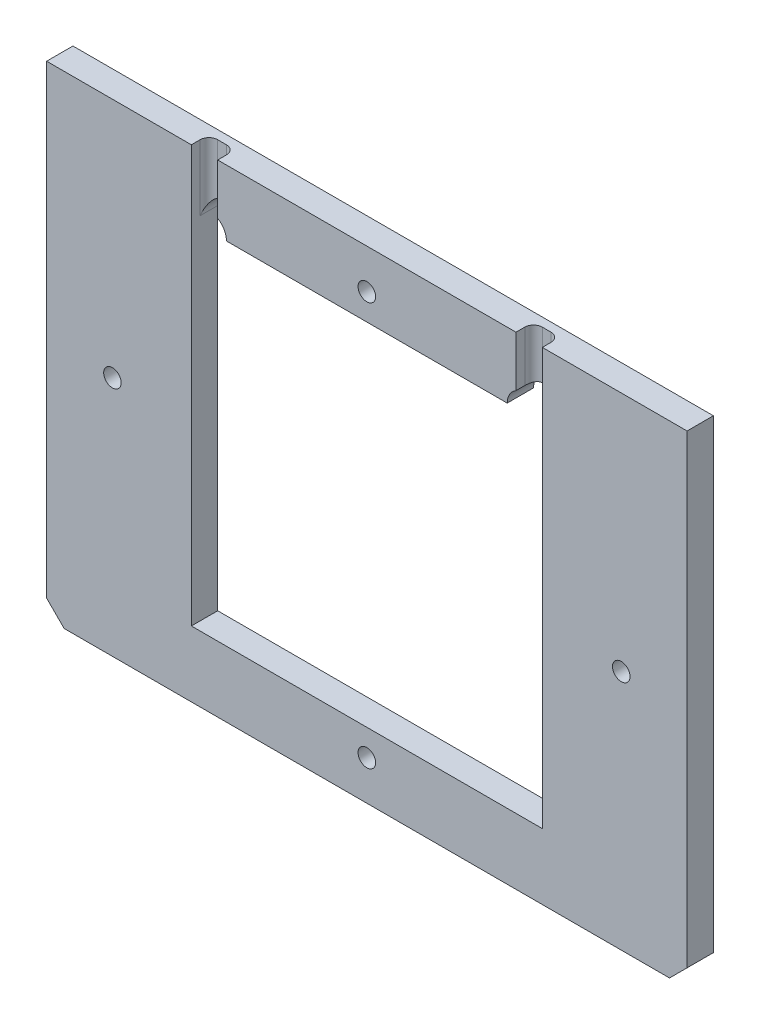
from build123d import *

# Parameters (mm, degrees)
ESQUISSE1_W             = 73
ESQUISSE1_H             = 55
ESQUISSE1_R             = 1
EXTRUSION1_DEPTH        = 3
ESQUISSE2_W             = 3
ESQUISSE2_H             = 7.5
ENL_V_MAT_EXTRU_1_DEPTH = 2
CONG_1_R                = 1
ESQUISSE3_R             = 1
ENL_V_MAT_EXTRU_4_DEPTH = 61.687556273
ENL_V_MAT_EXTRU_5_DEPTH = 1.5
CHANFREIN1_SIZE         = 2


with BuildPart() as part:
    # Esquisse1 → Extrusion1 (new body)
    with BuildSketch(Plane.XY):
        with Locations((-14.277874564, 5.599651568)):
            Rectangle(ESQUISSE1_W, ESQUISSE1_H)
        with Locations((-14.277874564, 28.599651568)):
            Circle(ESQUISSE1_R, mode=Mode.SUBTRACT)
        with Locations((-14.277874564, -17.400348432)):
            Circle(ESQUISSE1_R, mode=Mode.SUBTRACT)
        with BuildLine():
            Line((-30.277874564, 25.599651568), (1.722125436, 25.599651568))
            ThreePointArc((1.722125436, 25.599651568), (3.722125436, 27.599651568), (5.722125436, 25.599651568))
            Line((5.722125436, 25.599651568), (5.722125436, -14.400348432))
            Line((5.722125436, -14.400348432), (-34.277874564, -14.400348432))
            Line((-34.277874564, -14.400348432), (-34.277874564, 25.599651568))
            ThreePointArc((-34.277874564, 25.599651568), (-32.277874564, 27.599651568), (-30.277874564, 25.599651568))
        make_face(mode=Mode.SUBTRACT)
    extrude(amount=EXTRUSION1_DEPTH)

    # Esquisse2 → Enl_v. mat.-Extru.1 (cut)
    with BuildSketch(Plane.XY.offset(3)):
        with Locations((-32.777874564, 29.349651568)):
            Rectangle(ESQUISSE2_W, ESQUISSE2_H)
        with Locations((4.222125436, 29.349651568)):
            Rectangle(ESQUISSE2_W, ESQUISSE2_H)
    extrude(amount=-ENL_V_MAT_EXTRU_1_DEPTH, mode=Mode.SUBTRACT)

    # Cong_1
    cong_1_edges = [part.edges().sort_by_distance(p)[0] for p in [
        (-34.277874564, 29.349651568, 1),
        (-31.277874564, 30.215676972, 1),
        (2.722125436, 30.215676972, 1),
        (5.722125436, 29.349651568, 1),
    ]]
    fillet(cong_1_edges, radius=CONG_1_R)

    # Esquisse3 → Enl_v. mat.-Extru.4 (cut, through all)
    with BuildSketch(Plane.XY):
        with Locations((-43.277874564, 5.599651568)):
            Circle(ESQUISSE3_R)
        with Locations((14.722125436, 5.599651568)):
            Circle(ESQUISSE3_R)
    extrude(amount=ENL_V_MAT_EXTRU_4_DEPTH, mode=Mode.SUBTRACT)

    # Esquisse4 → Enl_v. mat.-Extru.5 (cut)
    with BuildSketch(Plane.XY):
        Polygon((-41.319980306, 4.469260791), (-41.319980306, 6.730042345), (-43.277874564, 7.860433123), (-45.235768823, 6.730042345), (-45.235768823, 4.469260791), (-43.277874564, 3.338870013), align=None)
        Polygon((17.031526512, 5.599651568), (15.876825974, 7.599651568), (13.567424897, 7.599651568), (12.412724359, 5.599651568), (13.567424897, 3.599651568), (15.876825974, 3.599651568), align=None)
    extrude(amount=ENL_V_MAT_EXTRU_5_DEPTH, mode=Mode.SUBTRACT)

    # Chanfrein1
    chanfrein1_edges = [part.edges().sort_by_distance(p)[0] for p in [
        (22.222125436, -21.900348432, 1.5),
        (-50.777874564, -21.900348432, 1.5),
    ]]
    chamfer(chanfrein1_edges, length=CHANFREIN1_SIZE)


solid = part.part
